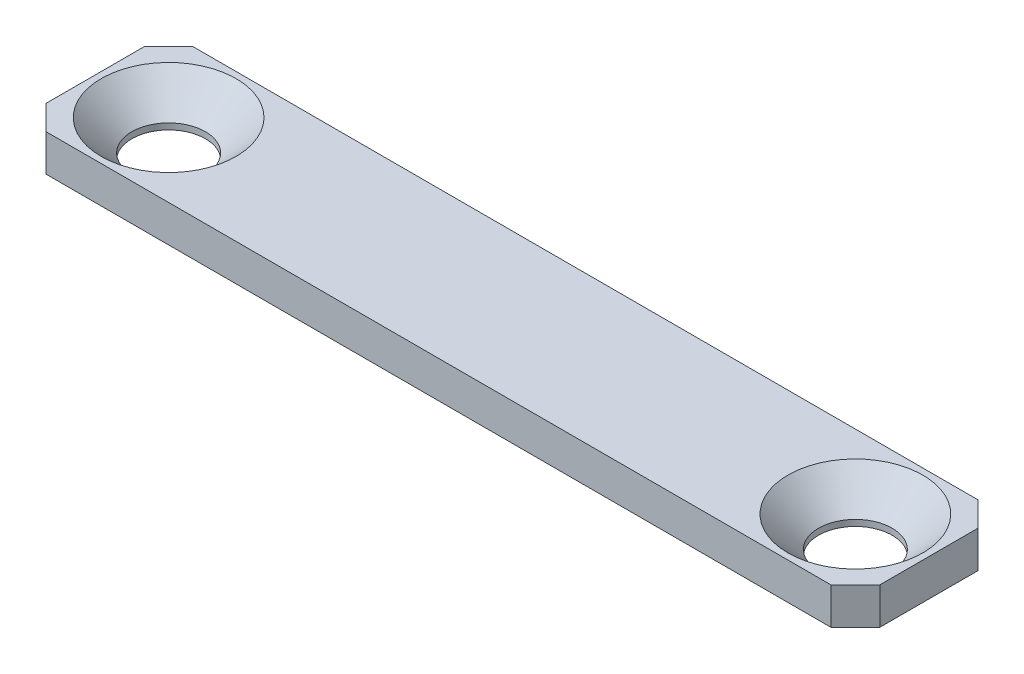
ISO-10303-21;
HEADER;
FILE_DESCRIPTION(('STEP AP214'),'2;1');
FILE_NAME('part.step','',(''),(''),'','','');
FILE_SCHEMA(('AUTOMOTIVE_DESIGN { 1 0 10303 214 1 1 1 1 }'));
ENDSEC;
DATA;
#1=APPLICATION_CONTEXT('core data for automotive mechanical design processes');
#2=APPLICATION_PROTOCOL_DEFINITION('international standard','automotive_design',2000,#1);
#3=PRODUCT_CONTEXT('',#1,'mechanical');
#4=PRODUCT('Part','Part','',(#3));
#5=PRODUCT_RELATED_PRODUCT_CATEGORY('part','',(#4));
#6=PRODUCT_DEFINITION_FORMATION('','',#4);
#7=PRODUCT_DEFINITION_CONTEXT('part definition',#1,'design');
#8=PRODUCT_DEFINITION('design','',#6,#7);
#9=PRODUCT_DEFINITION_SHAPE('','',#8);
#10=(LENGTH_UNIT() NAMED_UNIT(*) SI_UNIT(.MILLI.,.METRE.));
#11=(NAMED_UNIT(*) PLANE_ANGLE_UNIT() SI_UNIT($,.RADIAN.));
#12=(NAMED_UNIT(*) SI_UNIT($,.STERADIAN.) SOLID_ANGLE_UNIT());
#13=UNCERTAINTY_MEASURE_WITH_UNIT(LENGTH_MEASURE(1.E-05),#10,'distance_accuracy_value','');
#14=(GEOMETRIC_REPRESENTATION_CONTEXT(3) GLOBAL_UNCERTAINTY_ASSIGNED_CONTEXT((#13)) GLOBAL_UNIT_ASSIGNED_CONTEXT((#10,
#11,#12)) REPRESENTATION_CONTEXT('',''));
#15=CARTESIAN_POINT('',(0.,0.,0.));
#16=DIRECTION('',(0.,0.,1.));
#17=DIRECTION('',(1.,0.,0.));
#18=AXIS2_PLACEMENT_3D('',#15,#16,#17);
#19=CARTESIAN_POINT('',(0.,1.5,0.));
#20=DIRECTION('',(1.,0.,0.));
#21=DIRECTION('',(0.,0.,-1.));
#22=AXIS2_PLACEMENT_3D('',#19,#20,#21);
#23=PLANE('',#22);
#24=DIRECTION('',(0.,0.,1.));
#25=VECTOR('',#24,1.);
#26=CARTESIAN_POINT('',(0.,1.5,0.));
#27=LINE('',#26,#25);
#28=CARTESIAN_POINT('',(0.,1.5,-5.));
#29=VERTEX_POINT('',#28);
#30=CARTESIAN_POINT('',(0.,1.5,-1.00000000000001));
#31=VERTEX_POINT('',#30);
#32=EDGE_CURVE('E129',#29,#31,#27,.T.);
#33=ORIENTED_EDGE('',*,*,#32,.F.);
#34=DIRECTION('',(0.,-1.,0.));
#35=VECTOR('',#34,1.);
#36=CARTESIAN_POINT('',(0.,1.5,-5.));
#37=LINE('',#36,#35);
#38=CARTESIAN_POINT('',(0.,0.,-5.));
#39=VERTEX_POINT('',#38);
#40=EDGE_CURVE('E11',#29,#39,#37,.T.);
#41=ORIENTED_EDGE('',*,*,#40,.T.);
#42=DIRECTION('',(0.,0.,1.));
#43=VECTOR('',#42,1.);
#44=CARTESIAN_POINT('',(0.,0.,0.));
#45=LINE('',#44,#43);
#46=CARTESIAN_POINT('',(0.,0.,-1.00000000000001));
#47=VERTEX_POINT('',#46);
#48=EDGE_CURVE('E131',#39,#47,#45,.T.);
#49=ORIENTED_EDGE('',*,*,#48,.T.);
#50=DIRECTION('',(0.,1.,0.));
#51=VECTOR('',#50,1.);
#52=CARTESIAN_POINT('',(0.,1.5,-1.00000000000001));
#53=LINE('',#52,#51);
#54=EDGE_CURVE('E42',#47,#31,#53,.T.);
#55=ORIENTED_EDGE('',*,*,#54,.T.);
#56=EDGE_LOOP('',(#33,#41,#49,#55));
#57=FACE_BOUND('',#56,.T.);
#58=ADVANCED_FACE('F34',(#57),#23,.F.);
#59=CARTESIAN_POINT('',(0.,1.5,0.));
#60=DIRECTION('',(0.,0.,-1.));
#61=DIRECTION('',(-1.,0.,0.));
#62=AXIS2_PLACEMENT_3D('',#59,#60,#61);
#63=PLANE('',#62);
#64=DIRECTION('',(1.,0.,0.));
#65=VECTOR('',#64,1.);
#66=CARTESIAN_POINT('',(0.,0.,0.));
#67=LINE('',#66,#65);
#68=CARTESIAN_POINT('',(1.,0.,0.));
#69=VERTEX_POINT('',#68);
#70=CARTESIAN_POINT('',(33.,0.,0.));
#71=VERTEX_POINT('',#70);
#72=EDGE_CURVE('E127',#69,#71,#67,.T.);
#73=ORIENTED_EDGE('',*,*,#72,.T.);
#74=DIRECTION('',(0.,1.,0.));
#75=VECTOR('',#74,1.);
#76=CARTESIAN_POINT('',(33.,1.5,0.));
#77=LINE('',#76,#75);
#78=CARTESIAN_POINT('',(33.,1.5,0.));
#79=VERTEX_POINT('',#78);
#80=EDGE_CURVE('E106',#71,#79,#77,.T.);
#81=ORIENTED_EDGE('',*,*,#80,.T.);
#82=DIRECTION('',(1.,0.,0.));
#83=VECTOR('',#82,1.);
#84=CARTESIAN_POINT('',(0.,1.5,0.));
#85=LINE('',#84,#83);
#86=CARTESIAN_POINT('',(1.,1.5,0.));
#87=VERTEX_POINT('',#86);
#88=EDGE_CURVE('E167',#87,#79,#85,.T.);
#89=ORIENTED_EDGE('',*,*,#88,.F.);
#90=DIRECTION('',(0.,-1.,0.));
#91=VECTOR('',#90,1.);
#92=CARTESIAN_POINT('',(1.,1.5,0.));
#93=LINE('',#92,#91);
#94=EDGE_CURVE('E111',#87,#69,#93,.T.);
#95=ORIENTED_EDGE('',*,*,#94,.T.);
#96=EDGE_LOOP('',(#73,#81,#89,#95));
#97=FACE_BOUND('',#96,.T.);
#98=ADVANCED_FACE('F171',(#97),#63,.F.);
#99=CARTESIAN_POINT('',(34.,1.5,0.));
#100=DIRECTION('',(-1.,0.,0.));
#101=DIRECTION('',(0.,0.,1.));
#102=AXIS2_PLACEMENT_3D('',#99,#100,#101);
#103=PLANE('',#102);
#104=DIRECTION('',(0.,0.,-1.));
#105=VECTOR('',#104,1.);
#106=CARTESIAN_POINT('',(34.,1.5,0.));
#107=LINE('',#106,#105);
#108=CARTESIAN_POINT('',(34.,1.5,-1.));
#109=VERTEX_POINT('',#108);
#110=CARTESIAN_POINT('',(34.,1.5,-4.99999999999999));
#111=VERTEX_POINT('',#110);
#112=EDGE_CURVE('E120',#109,#111,#107,.T.);
#113=ORIENTED_EDGE('',*,*,#112,.F.);
#114=DIRECTION('',(0.,-1.,0.));
#115=VECTOR('',#114,1.);
#116=CARTESIAN_POINT('',(34.,1.5,-1.));
#117=LINE('',#116,#115);
#118=CARTESIAN_POINT('',(34.,0.,-1.));
#119=VERTEX_POINT('',#118);
#120=EDGE_CURVE('E105',#109,#119,#117,.T.);
#121=ORIENTED_EDGE('',*,*,#120,.T.);
#122=DIRECTION('',(0.,0.,-1.));
#123=VECTOR('',#122,1.);
#124=CARTESIAN_POINT('',(34.,0.,0.));
#125=LINE('',#124,#123);
#126=CARTESIAN_POINT('',(34.,0.,-4.99999999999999));
#127=VERTEX_POINT('',#126);
#128=EDGE_CURVE('E118',#119,#127,#125,.T.);
#129=ORIENTED_EDGE('',*,*,#128,.T.);
#130=DIRECTION('',(0.,1.,0.));
#131=VECTOR('',#130,1.);
#132=CARTESIAN_POINT('',(34.,1.5,-4.99999999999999));
#133=LINE('',#132,#131);
#134=EDGE_CURVE('E122',#127,#111,#133,.T.);
#135=ORIENTED_EDGE('',*,*,#134,.T.);
#136=EDGE_LOOP('',(#113,#121,#129,#135));
#137=FACE_BOUND('',#136,.T.);
#138=ADVANCED_FACE('F117',(#137),#103,.F.);
#139=CARTESIAN_POINT('',(0.,1.5,-6.));
#140=DIRECTION('',(0.,0.,1.));
#141=DIRECTION('',(1.,0.,0.));
#142=AXIS2_PLACEMENT_3D('',#139,#140,#141);
#143=PLANE('',#142);
#144=DIRECTION('',(-1.,0.,0.));
#145=VECTOR('',#144,1.);
#146=CARTESIAN_POINT('',(0.,1.5,-6.));
#147=LINE('',#146,#145);
#148=CARTESIAN_POINT('',(33.,1.5,-6.));
#149=VERTEX_POINT('',#148);
#150=CARTESIAN_POINT('',(1.,1.5,-6.));
#151=VERTEX_POINT('',#150);
#152=EDGE_CURVE('E135',#149,#151,#147,.T.);
#153=ORIENTED_EDGE('',*,*,#152,.F.);
#154=DIRECTION('',(0.,-1.,0.));
#155=VECTOR('',#154,1.);
#156=CARTESIAN_POINT('',(33.,1.5,-6.));
#157=LINE('',#156,#155);
#158=CARTESIAN_POINT('',(33.,0.,-6.));
#159=VERTEX_POINT('',#158);
#160=EDGE_CURVE('E152',#149,#159,#157,.T.);
#161=ORIENTED_EDGE('',*,*,#160,.T.);
#162=DIRECTION('',(-1.,0.,0.));
#163=VECTOR('',#162,1.);
#164=CARTESIAN_POINT('',(0.,0.,-6.));
#165=LINE('',#164,#163);
#166=CARTESIAN_POINT('',(1.,0.,-6.));
#167=VERTEX_POINT('',#166);
#168=EDGE_CURVE('E126',#159,#167,#165,.T.);
#169=ORIENTED_EDGE('',*,*,#168,.T.);
#170=DIRECTION('',(0.,1.,0.));
#171=VECTOR('',#170,1.);
#172=CARTESIAN_POINT('',(1.,1.5,-6.));
#173=LINE('',#172,#171);
#174=EDGE_CURVE('E49',#167,#151,#173,.T.);
#175=ORIENTED_EDGE('',*,*,#174,.T.);
#176=EDGE_LOOP('',(#153,#161,#169,#175));
#177=FACE_BOUND('',#176,.T.);
#178=ADVANCED_FACE('F199',(#177),#143,.F.);
#179=CARTESIAN_POINT('',(0.,1.5,-6.));
#180=DIRECTION('',(0.,-1.,0.));
#181=DIRECTION('',(0.,0.,-1.));
#182=AXIS2_PLACEMENT_3D('',#179,#180,#181);
#183=PLANE('',#182);
#184=CARTESIAN_POINT('',(3.,1.5,-3.));
#185=DIRECTION('',(0.,1.,0.));
#186=DIRECTION('',(0.,0.,1.));
#187=AXIS2_PLACEMENT_3D('',#184,#185,#186);
#188=CIRCLE('',#187,2.75);
#189=CARTESIAN_POINT('',(3.,1.5,-0.250000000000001));
#190=VERTEX_POINT('',#189);
#191=EDGE_CURVE('E191',#190,#190,#188,.T.);
#192=ORIENTED_EDGE('',*,*,#191,.F.);
#193=EDGE_LOOP('',(#192));
#194=FACE_BOUND('',#193,.T.);
#195=CARTESIAN_POINT('',(31.,1.5,-3.));
#196=DIRECTION('',(0.,1.,0.));
#197=DIRECTION('',(0.,0.,1.));
#198=AXIS2_PLACEMENT_3D('',#195,#196,#197);
#199=CIRCLE('',#198,2.75);
#200=CARTESIAN_POINT('',(31.,1.5,-0.249999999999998));
#201=VERTEX_POINT('',#200);
#202=EDGE_CURVE('E182',#201,#201,#199,.T.);
#203=ORIENTED_EDGE('',*,*,#202,.F.);
#204=EDGE_LOOP('',(#203));
#205=FACE_BOUND('',#204,.T.);
#206=ORIENTED_EDGE('',*,*,#88,.T.);
#207=DIRECTION('',(-0.707106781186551,0.,0.707106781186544));
#208=VECTOR('',#207,1.);
#209=CARTESIAN_POINT('',(34.,1.5,-1.));
#210=LINE('',#209,#208);
#211=EDGE_CURVE('E149',#79,#109,#210,.F.);
#212=ORIENTED_EDGE('',*,*,#211,.T.);
#213=ORIENTED_EDGE('',*,*,#112,.T.);
#214=DIRECTION('',(0.707106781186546,0.,0.707106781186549));
#215=VECTOR('',#214,1.);
#216=CARTESIAN_POINT('',(33.,1.5,-6.));
#217=LINE('',#216,#215);
#218=EDGE_CURVE('E56',#111,#149,#217,.F.);
#219=ORIENTED_EDGE('',*,*,#218,.T.);
#220=ORIENTED_EDGE('',*,*,#152,.T.);
#221=DIRECTION('',(0.707106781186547,0.,-0.707106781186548));
#222=VECTOR('',#221,1.);
#223=CARTESIAN_POINT('',(0.,1.5,-5.));
#224=LINE('',#223,#222);
#225=EDGE_CURVE('E146',#151,#29,#224,.F.);
#226=ORIENTED_EDGE('',*,*,#225,.T.);
#227=ORIENTED_EDGE('',*,*,#32,.T.);
#228=DIRECTION('',(-0.707106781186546,0.,-0.707106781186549));
#229=VECTOR('',#228,1.);
#230=CARTESIAN_POINT('',(1.,1.5,0.));
#231=LINE('',#230,#229);
#232=EDGE_CURVE('E144',#31,#87,#231,.F.);
#233=ORIENTED_EDGE('',*,*,#232,.T.);
#234=EDGE_LOOP('',(#206,#212,#213,#219,#220,#226,#227,#233));
#235=FACE_BOUND('',#234,.T.);
#236=ADVANCED_FACE('F164',(#194,#205,#235),#183,.F.);
#237=CARTESIAN_POINT('',(0.,0.,-6.));
#238=DIRECTION('',(0.,-1.,0.));
#239=DIRECTION('',(0.,0.,-1.));
#240=AXIS2_PLACEMENT_3D('',#237,#238,#239);
#241=PLANE('',#240);
#242=CARTESIAN_POINT('',(3.,0.,-3.));
#243=DIRECTION('',(0.,1.,0.));
#244=DIRECTION('',(0.,0.,1.));
#245=AXIS2_PLACEMENT_3D('',#242,#243,#244);
#246=CIRCLE('',#245,1.5);
#247=CARTESIAN_POINT('',(3.,0.,-1.5));
#248=VERTEX_POINT('',#247);
#249=EDGE_CURVE('E185',#248,#248,#246,.T.);
#250=ORIENTED_EDGE('',*,*,#249,.T.);
#251=EDGE_LOOP('',(#250));
#252=FACE_BOUND('',#251,.T.);
#253=CARTESIAN_POINT('',(31.,0.,-3.));
#254=DIRECTION('',(0.,1.,0.));
#255=DIRECTION('',(0.,0.,1.));
#256=AXIS2_PLACEMENT_3D('',#253,#254,#255);
#257=CIRCLE('',#256,1.5);
#258=CARTESIAN_POINT('',(31.,0.,-1.5));
#259=VERTEX_POINT('',#258);
#260=EDGE_CURVE('E172',#259,#259,#257,.T.);
#261=ORIENTED_EDGE('',*,*,#260,.T.);
#262=EDGE_LOOP('',(#261));
#263=FACE_BOUND('',#262,.T.);
#264=ORIENTED_EDGE('',*,*,#128,.F.);
#265=DIRECTION('',(0.707106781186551,0.,-0.707106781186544));
#266=VECTOR('',#265,1.);
#267=CARTESIAN_POINT('',(19.4999999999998,0.,13.5));
#268=LINE('',#267,#266);
#269=EDGE_CURVE('E101',#119,#71,#268,.F.);
#270=ORIENTED_EDGE('',*,*,#269,.T.);
#271=ORIENTED_EDGE('',*,*,#72,.F.);
#272=DIRECTION('',(0.707106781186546,0.,0.707106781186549));
#273=VECTOR('',#272,1.);
#274=CARTESIAN_POINT('',(-2.5,0.,-3.50000000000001));
#275=LINE('',#274,#273);
#276=EDGE_CURVE('E121',#69,#47,#275,.F.);
#277=ORIENTED_EDGE('',*,*,#276,.T.);
#278=ORIENTED_EDGE('',*,*,#48,.F.);
#279=DIRECTION('',(-0.707106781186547,0.,0.707106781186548));
#280=VECTOR('',#279,1.);
#281=CARTESIAN_POINT('',(0.500000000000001,0.,-5.5));
#282=LINE('',#281,#280);
#283=EDGE_CURVE('E138',#39,#167,#282,.F.);
#284=ORIENTED_EDGE('',*,*,#283,.T.);
#285=ORIENTED_EDGE('',*,*,#168,.F.);
#286=DIRECTION('',(-0.707106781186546,0.,-0.707106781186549));
#287=VECTOR('',#286,1.);
#288=CARTESIAN_POINT('',(16.5000000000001,0.,-22.5));
#289=LINE('',#288,#287);
#290=EDGE_CURVE('E112',#159,#127,#289,.F.);
#291=ORIENTED_EDGE('',*,*,#290,.T.);
#292=EDGE_LOOP('',(#264,#270,#271,#277,#278,#284,#285,#291));
#293=FACE_BOUND('',#292,.T.);
#294=ADVANCED_FACE('F124',(#252,#263,#293),#241,.T.);
#295=CARTESIAN_POINT('',(31.,1.5,-3.));
#296=DIRECTION('',(0.,1.,0.));
#297=DIRECTION('',(0.,0.,1.));
#298=AXIS2_PLACEMENT_3D('',#295,#296,#297);
#299=CYLINDRICAL_SURFACE('',#298,1.5);
#300=ORIENTED_EDGE('',*,*,#260,.F.);
#301=EDGE_LOOP('',(#300));
#302=FACE_BOUND('',#301,.T.);
#303=CARTESIAN_POINT('',(31.,0.250000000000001,-3.));
#304=DIRECTION('',(0.,1.,0.));
#305=DIRECTION('',(0.,0.,1.));
#306=AXIS2_PLACEMENT_3D('',#303,#304,#305);
#307=CIRCLE('',#306,1.5);
#308=CARTESIAN_POINT('',(31.,0.250000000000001,-1.5));
#309=VERTEX_POINT('',#308);
#310=EDGE_CURVE('E174',#309,#309,#307,.T.);
#311=ORIENTED_EDGE('',*,*,#310,.T.);
#312=EDGE_LOOP('',(#311));
#313=FACE_BOUND('',#312,.T.);
#314=ADVANCED_FACE('F206',(#302,#313),#299,.F.);
#315=CARTESIAN_POINT('',(31.,1.5,-3.));
#316=DIRECTION('',(0.,1.,0.));
#317=DIRECTION('',(0.,0.,1.));
#318=AXIS2_PLACEMENT_3D('',#315,#316,#317);
#319=CONICAL_SURFACE('',#318,2.75,0.785398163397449);
#320=ORIENTED_EDGE('',*,*,#310,.F.);
#321=EDGE_LOOP('',(#320));
#322=FACE_BOUND('',#321,.T.);
#323=ORIENTED_EDGE('',*,*,#202,.T.);
#324=EDGE_LOOP('',(#323));
#325=FACE_BOUND('',#324,.T.);
#326=ADVANCED_FACE('F203',(#322,#325),#319,.F.);
#327=CARTESIAN_POINT('',(3.,1.5,-3.));
#328=DIRECTION('',(0.,1.,0.));
#329=DIRECTION('',(0.,0.,1.));
#330=AXIS2_PLACEMENT_3D('',#327,#328,#329);
#331=CYLINDRICAL_SURFACE('',#330,1.5);
#332=ORIENTED_EDGE('',*,*,#249,.F.);
#333=EDGE_LOOP('',(#332));
#334=FACE_BOUND('',#333,.T.);
#335=CARTESIAN_POINT('',(3.,0.250000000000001,-3.));
#336=DIRECTION('',(0.,1.,0.));
#337=DIRECTION('',(0.,0.,1.));
#338=AXIS2_PLACEMENT_3D('',#335,#336,#337);
#339=CIRCLE('',#338,1.5);
#340=CARTESIAN_POINT('',(3.,0.250000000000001,-1.5));
#341=VERTEX_POINT('',#340);
#342=EDGE_CURVE('E188',#341,#341,#339,.T.);
#343=ORIENTED_EDGE('',*,*,#342,.T.);
#344=EDGE_LOOP('',(#343));
#345=FACE_BOUND('',#344,.T.);
#346=ADVANCED_FACE('F205',(#334,#345),#331,.F.);
#347=CARTESIAN_POINT('',(3.,1.5,-3.));
#348=DIRECTION('',(0.,1.,0.));
#349=DIRECTION('',(0.,0.,1.));
#350=AXIS2_PLACEMENT_3D('',#347,#348,#349);
#351=CONICAL_SURFACE('',#350,2.75,0.785398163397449);
#352=ORIENTED_EDGE('',*,*,#342,.F.);
#353=EDGE_LOOP('',(#352));
#354=FACE_BOUND('',#353,.T.);
#355=ORIENTED_EDGE('',*,*,#191,.T.);
#356=EDGE_LOOP('',(#355));
#357=FACE_BOUND('',#356,.T.);
#358=ADVANCED_FACE('F195',(#354,#357),#351,.F.);
#359=CARTESIAN_POINT('',(34.,1.5,-1.));
#360=DIRECTION('',(-0.707106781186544,0.,-0.707106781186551));
#361=DIRECTION('',(-0.707106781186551,0.,0.707106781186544));
#362=AXIS2_PLACEMENT_3D('',#359,#360,#361);
#363=PLANE('',#362);
#364=ORIENTED_EDGE('',*,*,#211,.F.);
#365=ORIENTED_EDGE('',*,*,#80,.F.);
#366=ORIENTED_EDGE('',*,*,#269,.F.);
#367=ORIENTED_EDGE('',*,*,#120,.F.);
#368=EDGE_LOOP('',(#364,#365,#366,#367));
#369=FACE_BOUND('',#368,.T.);
#370=ADVANCED_FACE('F104',(#369),#363,.F.);
#371=CARTESIAN_POINT('',(33.,1.5,-6.));
#372=DIRECTION('',(-0.707106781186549,0.,0.707106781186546));
#373=DIRECTION('',(0.707106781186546,0.,0.707106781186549));
#374=AXIS2_PLACEMENT_3D('',#371,#372,#373);
#375=PLANE('',#374);
#376=ORIENTED_EDGE('',*,*,#218,.F.);
#377=ORIENTED_EDGE('',*,*,#134,.F.);
#378=ORIENTED_EDGE('',*,*,#290,.F.);
#379=ORIENTED_EDGE('',*,*,#160,.F.);
#380=EDGE_LOOP('',(#376,#377,#378,#379));
#381=FACE_BOUND('',#380,.T.);
#382=ADVANCED_FACE('F228',(#381),#375,.F.);
#383=CARTESIAN_POINT('',(0.,1.5,-5.));
#384=DIRECTION('',(0.707106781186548,0.,0.707106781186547));
#385=DIRECTION('',(0.707106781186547,0.,-0.707106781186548));
#386=AXIS2_PLACEMENT_3D('',#383,#384,#385);
#387=PLANE('',#386);
#388=ORIENTED_EDGE('',*,*,#225,.F.);
#389=ORIENTED_EDGE('',*,*,#174,.F.);
#390=ORIENTED_EDGE('',*,*,#283,.F.);
#391=ORIENTED_EDGE('',*,*,#40,.F.);
#392=EDGE_LOOP('',(#388,#389,#390,#391));
#393=FACE_BOUND('',#392,.T.);
#394=ADVANCED_FACE('F230',(#393),#387,.F.);
#395=CARTESIAN_POINT('',(1.,1.5,0.));
#396=DIRECTION('',(0.707106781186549,0.,-0.707106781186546));
#397=DIRECTION('',(-0.707106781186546,0.,-0.707106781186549));
#398=AXIS2_PLACEMENT_3D('',#395,#396,#397);
#399=PLANE('',#398);
#400=ORIENTED_EDGE('',*,*,#232,.F.);
#401=ORIENTED_EDGE('',*,*,#54,.F.);
#402=ORIENTED_EDGE('',*,*,#276,.F.);
#403=ORIENTED_EDGE('',*,*,#94,.F.);
#404=EDGE_LOOP('',(#400,#401,#402,#403));
#405=FACE_BOUND('',#404,.T.);
#406=ADVANCED_FACE('F36',(#405),#399,.F.);
#407=CLOSED_SHELL('',(#58,#98,#138,#178,#236,#294,#314,#326,#346,#358,#370,#382,#394,#406));
#408=MANIFOLD_SOLID_BREP('B2',#407);
#409=ADVANCED_BREP_SHAPE_REPRESENTATION('',(#18,#408),#14);
#410=SHAPE_DEFINITION_REPRESENTATION(#9,#409);
ENDSEC;
END-ISO-10303-21;
